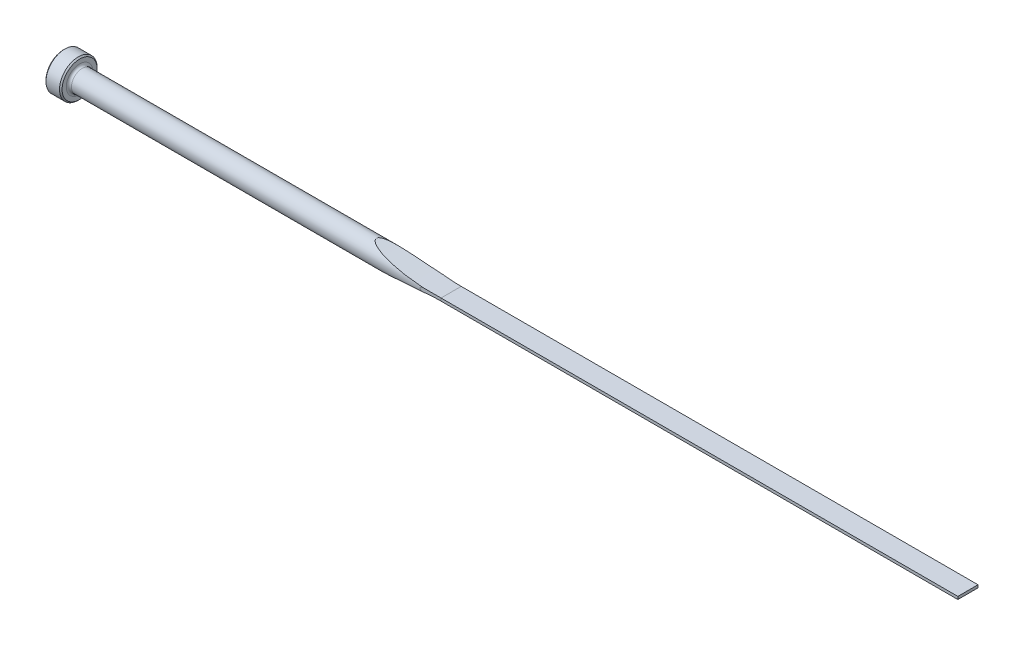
ISO-10303-21;
HEADER;
FILE_DESCRIPTION(('STEP AP214'),'2;1');
FILE_NAME('part.step','',(''),(''),'','','');
FILE_SCHEMA(('AUTOMOTIVE_DESIGN { 1 0 10303 214 1 1 1 1 }'));
ENDSEC;
DATA;
#1=APPLICATION_CONTEXT('core data for automotive mechanical design processes');
#2=APPLICATION_PROTOCOL_DEFINITION('international standard','automotive_design',2000,#1);
#3=PRODUCT_CONTEXT('',#1,'mechanical');
#4=PRODUCT('Part','Part','',(#3));
#5=PRODUCT_RELATED_PRODUCT_CATEGORY('part','',(#4));
#6=PRODUCT_DEFINITION_FORMATION('','',#4);
#7=PRODUCT_DEFINITION_CONTEXT('part definition',#1,'design');
#8=PRODUCT_DEFINITION('design','',#6,#7);
#9=PRODUCT_DEFINITION_SHAPE('','',#8);
#10=(LENGTH_UNIT() NAMED_UNIT(*) SI_UNIT(.MILLI.,.METRE.));
#11=(NAMED_UNIT(*) PLANE_ANGLE_UNIT() SI_UNIT($,.RADIAN.));
#12=(NAMED_UNIT(*) SI_UNIT($,.STERADIAN.) SOLID_ANGLE_UNIT());
#13=UNCERTAINTY_MEASURE_WITH_UNIT(LENGTH_MEASURE(1.E-05),#10,'distance_accuracy_value','');
#14=(GEOMETRIC_REPRESENTATION_CONTEXT(3) GLOBAL_UNCERTAINTY_ASSIGNED_CONTEXT((#13)) GLOBAL_UNIT_ASSIGNED_CONTEXT((#10,
#11,#12)) REPRESENTATION_CONTEXT('',''));
#15=CARTESIAN_POINT('',(0.,0.,0.));
#16=DIRECTION('',(0.,0.,1.));
#17=DIRECTION('',(1.,0.,0.));
#18=AXIS2_PLACEMENT_3D('',#15,#16,#17);
#19=CARTESIAN_POINT('',(0.,0.,0.));
#20=DIRECTION('',(-1.,0.,0.));
#21=DIRECTION('',(0.,0.,1.));
#22=AXIS2_PLACEMENT_3D('',#19,#20,#21);
#23=CYLINDRICAL_SURFACE('',#22,3.175);
#24=CARTESIAN_POINT('',(5.5118,0.,0.));
#25=DIRECTION('',(-1.,0.,0.));
#26=DIRECTION('',(0.,0.,1.));
#27=AXIS2_PLACEMENT_3D('',#24,#25,#26);
#28=CIRCLE('',#27,3.175);
#29=CARTESIAN_POINT('',(5.5118,0.,3.175));
#30=VERTEX_POINT('',#29);
#31=EDGE_CURVE('E153',#30,#30,#28,.F.);
#32=ORIENTED_EDGE('',*,*,#31,.T.);
#33=EDGE_LOOP('',(#32));
#34=FACE_BOUND('',#33,.T.);
#35=CARTESIAN_POINT('',(114.3,1.11760000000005,2.97179999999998));
#36=CARTESIAN_POINT('',(114.035795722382,1.11753103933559,2.97179889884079));
#37=CARTESIAN_POINT('',(113.771581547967,1.11446404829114,2.97297778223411));
#38=CARTESIAN_POINT('',(113.243191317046,1.10185346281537,2.97768913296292));
#39=CARTESIAN_POINT('',(112.979015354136,1.09230645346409,2.98122284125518));
#40=CARTESIAN_POINT('',(112.449383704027,1.06617269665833,2.99066695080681));
#41=CARTESIAN_POINT('',(112.183930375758,1.04954219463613,2.99659211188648));
#42=CARTESIAN_POINT('',(111.653787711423,1.00807205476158,3.01079697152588));
#43=CARTESIAN_POINT('',(111.389098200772,0.983234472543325,3.01907608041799));
#44=CARTESIAN_POINT('',(110.861578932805,0.92338352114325,3.03792875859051));
#45=CARTESIAN_POINT('',(110.598746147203,0.888396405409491,3.04849639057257));
#46=CARTESIAN_POINT('',(110.206465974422,0.825064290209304,3.06600005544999));
#47=CARTESIAN_POINT('',(110.076108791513,0.802161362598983,3.07210597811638));
#48=CARTESIAN_POINT('',(109.816355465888,0.751700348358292,3.08484243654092));
#49=CARTESIAN_POINT('',(109.686959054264,0.724143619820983,3.09147281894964));
#50=CARTESIAN_POINT('',(109.429407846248,0.662714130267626,3.10522998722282));
#51=CARTESIAN_POINT('',(109.301255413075,0.62883116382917,3.11235756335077));
#52=CARTESIAN_POINT('',(109.111128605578,0.570760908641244,3.12333709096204));
#53=CARTESIAN_POINT('',(109.048049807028,0.55017562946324,3.12704828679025));
#54=CARTESIAN_POINT('',(108.92304566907,0.505797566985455,3.13453462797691));
#55=CARTESIAN_POINT('',(108.861119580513,0.482006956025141,3.13830972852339));
#56=CARTESIAN_POINT('',(108.738826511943,0.429769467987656,3.14588980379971));
#57=CARTESIAN_POINT('',(108.678471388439,0.401294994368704,3.14969481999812));
#58=CARTESIAN_POINT('',(108.561395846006,0.337410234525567,3.1571914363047));
#59=CARTESIAN_POINT('',(108.504663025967,0.302025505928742,3.16088339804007));
#60=CARTESIAN_POINT('',(108.431845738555,0.243613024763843,3.16568281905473));
#61=CARTESIAN_POINT('',(108.411687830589,0.225790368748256,3.16701915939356));
#62=CARTESIAN_POINT('',(108.374124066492,0.187442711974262,3.16952077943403));
#63=CARTESIAN_POINT('',(108.356707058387,0.166929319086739,3.17068675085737));
#64=CARTESIAN_POINT('',(108.333583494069,0.132884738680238,3.17224001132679));
#65=CARTESIAN_POINT('',(108.326188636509,0.120518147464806,3.17273788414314));
#66=CARTESIAN_POINT('',(108.313260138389,0.0948283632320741,3.1736095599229));
#67=CARTESIAN_POINT('',(108.307725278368,0.081505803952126,3.17398344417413));
#68=CARTESIAN_POINT('',(108.299008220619,0.0538971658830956,3.1745727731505));
#69=CARTESIAN_POINT('',(108.295856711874,0.0396010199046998,3.17478615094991));
#70=CARTESIAN_POINT('',(108.2924789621,0.0106696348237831,3.17501485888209));
#71=CARTESIAN_POINT('',(108.292248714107,-0.00396511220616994,3.17503046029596));
#72=CARTESIAN_POINT('',(108.294559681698,-0.0309283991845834,3.17487397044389));
#73=CARTESIAN_POINT('',(108.29671675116,-0.0432925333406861,3.17472789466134));
#74=CARTESIAN_POINT('',(108.302965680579,-0.0675187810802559,3.17430516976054));
#75=CARTESIAN_POINT('',(108.307059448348,-0.0793803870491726,3.17402839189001));
#76=CARTESIAN_POINT('',(108.319137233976,-0.107852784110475,3.17321302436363));
#77=CARTESIAN_POINT('',(108.328045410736,-0.124065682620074,3.17261252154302));
#78=CARTESIAN_POINT('',(108.34823262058,-0.154926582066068,3.17125564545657));
#79=CARTESIAN_POINT('',(108.359518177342,-0.169570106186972,3.17049884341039));
#80=CARTESIAN_POINT('',(108.39443410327,-0.20990010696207,3.16816531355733));
#81=CARTESIAN_POINT('',(108.420099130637,-0.233790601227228,3.16645919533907));
#82=CARTESIAN_POINT('',(108.474292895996,-0.277993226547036,3.16288336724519));
#83=CARTESIAN_POINT('',(108.502830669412,-0.29829347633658,3.16101314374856));
#84=CARTESIAN_POINT('',(108.58234132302,-0.349789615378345,3.15584379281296));
#85=CARTESIAN_POINT('',(108.63488873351,-0.378519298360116,3.15247078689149));
#86=CARTESIAN_POINT('',(108.742307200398,-0.43132017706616,3.14567655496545));
#87=CARTESIAN_POINT('',(108.797183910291,-0.455379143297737,3.14225522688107));
#88=CARTESIAN_POINT('',(108.908570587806,-0.500302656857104,3.13541729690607));
#89=CARTESIAN_POINT('',(108.965087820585,-0.521149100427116,3.13200082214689));
#90=CARTESIAN_POINT('',(109.07889793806,-0.560302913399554,3.12523191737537));
#91=CARTESIAN_POINT('',(109.136189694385,-0.578613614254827,3.12187940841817));
#92=CARTESIAN_POINT('',(109.329729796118,-0.636913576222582,3.11074477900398));
#93=CARTESIAN_POINT('',(109.467313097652,-0.672489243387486,3.10314401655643));
#94=CARTESIAN_POINT('',(109.744130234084,-0.736755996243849,3.08850582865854));
#95=CARTESIAN_POINT('',(109.883365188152,-0.765442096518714,3.08146881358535));
#96=CARTESIAN_POINT('',(110.163129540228,-0.817784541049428,3.06799404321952));
#97=CARTESIAN_POINT('',(110.303661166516,-0.841429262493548,3.06155769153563));
#98=CARTESIAN_POINT('',(110.58537320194,-0.884713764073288,3.04932851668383));
#99=CARTESIAN_POINT('',(110.726553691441,-0.904353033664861,3.04353577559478));
#100=CARTESIAN_POINT('',(111.150689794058,-0.958348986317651,3.02714982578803));
#101=CARTESIAN_POINT('',(111.434309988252,-0.987796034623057,3.01754551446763));
#102=CARTESIAN_POINT('',(112.002086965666,-1.03680456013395,3.00105004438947));
#103=CARTESIAN_POINT('',(112.286242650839,-1.05637822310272,2.99415554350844));
#104=CARTESIAN_POINT('',(112.714916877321,-1.0796290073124,2.98581493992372));
#105=CARTESIAN_POINT('',(112.859256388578,-1.08638681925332,2.98335806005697));
#106=CARTESIAN_POINT('',(113.148064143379,-1.09788498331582,2.97914616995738));
#107=CARTESIAN_POINT('',(113.292532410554,-1.10262481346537,2.9773913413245));
#108=CARTESIAN_POINT('',(113.580840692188,-1.11015348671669,2.9745925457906));
#109=CARTESIAN_POINT('',(113.724680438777,-1.11295147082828,2.97354524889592));
#110=CARTESIAN_POINT('',(114.012346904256,-1.11667170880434,2.97214903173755));
#111=CARTESIAN_POINT('',(114.156173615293,-1.11759449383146,2.97179991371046));
#112=CARTESIAN_POINT('',(114.3,-1.11760000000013,2.97179999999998));
#113=B_SPLINE_CURVE_WITH_KNOTS('',3,(#35,#36,#37,#38,#39,#40,#41,#42,#43,#44,#45,#46,#47,#48,
#49,#50,#51,#52,#53,#54,#55,#56,#57,#58,#59,#60,#61,#62,#63,#64,#65,#66,#67,#68,#69,#70,#71,#72,
#73,#74,#75,#76,#77,#78,#79,#80,#81,#82,#83,#84,#85,#86,#87,#88,#89,#90,#91,#92,#93,#94,#95,#96,
#97,#98,#99,#100,#101,#102,#103,#104,#105,#106,#107,#108,#109,#110,#111,#112),.UNSPECIFIED.,.F.,
.F.,(4,2,2,2,2,2,2,2,2,2,2,2,2,2,2,2,2,2,2,2,2,2,2,2,2,2,2,2,2,2,2,2,2,2,2,2,2,2,4),(0.,
0.792608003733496,1.58563403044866,2.38363126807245,3.18142878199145,3.97718078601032,
4.37459807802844,4.77189959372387,5.16984765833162,5.36916585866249,5.5683496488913,
5.76875204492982,5.96842682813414,6.04909120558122,6.12941838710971,6.17255460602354,
6.21566248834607,6.2593164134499,6.30291045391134,6.34039079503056,6.37790813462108,
6.43311579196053,6.4884769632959,6.59320183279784,6.69826703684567,6.87774508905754,
7.05768691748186,7.23860836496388,7.41928981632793,7.84588397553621,8.27278590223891,
8.70066164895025,9.12859189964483,9.98423938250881,10.8388282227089,11.2723701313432,
11.7060241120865,12.137622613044,12.569098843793),.UNSPECIFIED.);
#114=CARTESIAN_POINT('',(109.07888962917,0.559850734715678,3.12525073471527));
#115=VERTEX_POINT('',#114);
#116=CARTESIAN_POINT('',(109.078889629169,-0.559850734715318,3.12525073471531));
#117=VERTEX_POINT('',#116);
#118=EDGE_CURVE('E156',#115,#117,#113,.T.);
#119=ORIENTED_EDGE('',*,*,#118,.F.);
#120=CARTESIAN_POINT('',(114.3,0.406399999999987,3.14888298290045));
#121=CARTESIAN_POINT('',(113.772803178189,0.406399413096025,3.14883682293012));
#122=CARTESIAN_POINT('',(113.245605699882,0.411089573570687,3.1482760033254));
#123=CARTESIAN_POINT('',(112.191212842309,0.429850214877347,3.14579424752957));
#124=CARTESIAN_POINT('',(111.664017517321,0.443923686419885,3.14387287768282));
#125=CARTESIAN_POINT('',(110.605273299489,0.481616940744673,3.13831417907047));
#126=CARTESIAN_POINT('',(110.073727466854,0.505320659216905,3.13466171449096));
#127=CARTESIAN_POINT('',(109.011333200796,0.562257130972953,3.12495310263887));
#128=CARTESIAN_POINT('',(108.480484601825,0.595486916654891,3.11889770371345));
#129=CARTESIAN_POINT('',(107.416801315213,0.671658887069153,3.1033881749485));
#130=CARTESIAN_POINT('',(106.88397036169,0.71464989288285,3.09391681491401));
#131=CARTESIAN_POINT('',(105.819242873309,0.810227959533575,3.07027392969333));
#132=CARTESIAN_POINT('',(105.287346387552,0.862815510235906,3.05610216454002));
#133=CARTESIAN_POINT('',(104.223889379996,0.9776476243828,3.02133113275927));
#134=CARTESIAN_POINT('',(103.69233094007,1.03990833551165,3.00072105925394));
#135=CARTESIAN_POINT('',(102.630877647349,1.17395582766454,2.95085902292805));
#136=CARTESIAN_POINT('',(102.100982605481,1.24574148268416,2.9216080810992));
#137=CARTESIAN_POINT('',(101.04631407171,1.39831156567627,2.85173438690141));
#138=CARTESIAN_POINT('',(100.52152863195,1.47904206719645,2.81117776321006));
#139=CARTESIAN_POINT('',(99.7364139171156,1.60701374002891,2.73870608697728));
#140=CARTESIAN_POINT('',(99.4749847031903,1.65082933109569,2.71260104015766));
#141=CARTESIAN_POINT('',(98.9530103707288,1.74071020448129,2.65582140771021));
#142=CARTESIAN_POINT('',(98.6924652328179,1.78677543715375,2.62514692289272));
#143=CARTESIAN_POINT('',(98.1732649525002,1.88095855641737,2.55850308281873));
#144=CARTESIAN_POINT('',(97.9146064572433,1.92906965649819,2.52255039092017));
#145=CARTESIAN_POINT('',(97.3986683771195,2.02739943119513,2.44422445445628));
#146=CARTESIAN_POINT('',(97.1413887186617,2.0776179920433,2.40185155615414));
#147=CARTESIAN_POINT('',(96.6288453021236,2.18000599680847,2.30932005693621));
#148=CARTESIAN_POINT('',(96.3735800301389,2.23217376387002,2.25916803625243));
#149=CARTESIAN_POINT('',(95.8655530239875,2.33831139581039,2.14913837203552));
#150=CARTESIAN_POINT('',(95.6127906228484,2.39228076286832,2.08926339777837));
#151=CARTESIAN_POINT('',(95.2868484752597,2.46334629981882,2.00329722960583));
#152=CARTESIAN_POINT('',(95.2119962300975,2.47976837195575,1.98294830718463));
#153=CARTESIAN_POINT('',(95.0626651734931,2.51273206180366,1.94100880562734));
#154=CARTESIAN_POINT('',(94.98818637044,2.52927368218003,1.91941819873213));
#155=CARTESIAN_POINT('',(94.7653356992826,2.57906834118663,1.85260027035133));
#156=CARTESIAN_POINT('',(94.6175981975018,2.61248057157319,1.80533950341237));
#157=CARTESIAN_POINT('',(94.3251288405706,2.67940118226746,1.70443079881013));
#158=CARTESIAN_POINT('',(94.1803862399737,2.71290840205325,1.65081343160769));
#159=CARTESIAN_POINT('',(93.8942424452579,2.77989194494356,1.5353510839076));
#160=CARTESIAN_POINT('',(93.7528393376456,2.81336827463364,1.47351095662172));
#161=CARTESIAN_POINT('',(93.5196072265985,2.86917007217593,1.36054096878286));
#162=CARTESIAN_POINT('',(93.4264055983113,2.8916329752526,1.31232429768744));
#163=CARTESIAN_POINT('',(93.242822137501,2.93618406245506,1.2093911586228));
#164=CARTESIAN_POINT('',(93.1524577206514,2.95826965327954,1.15464182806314));
#165=CARTESIAN_POINT('',(93.0072758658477,2.99398257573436,1.05752329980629));
#166=CARTESIAN_POINT('',(92.9509993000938,3.00788688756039,1.01744577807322));
#167=CARTESIAN_POINT('',(92.8413340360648,3.03509050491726,0.933175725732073));
#168=CARTESIAN_POINT('',(92.7879480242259,3.04838924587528,0.888979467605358));
#169=CARTESIAN_POINT('',(92.6856978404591,3.0739542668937,0.796075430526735));
#170=CARTESIAN_POINT('',(92.6368023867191,3.08622762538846,0.747404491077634));
#171=CARTESIAN_POINT('',(92.5449929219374,3.10934730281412,0.64448319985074));
#172=CARTESIAN_POINT('',(92.5020641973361,3.12019712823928,0.59024716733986));
#173=CARTESIAN_POINT('',(92.4353153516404,3.13711069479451,0.490885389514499));
#174=CARTESIAN_POINT('',(92.4094604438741,3.14367703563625,0.44722882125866));
#175=CARTESIAN_POINT('',(92.3639685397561,3.15524751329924,0.356543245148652));
#176=CARTESIAN_POINT('',(92.3443286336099,3.16025238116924,0.309515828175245));
#177=CARTESIAN_POINT('',(92.3128254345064,3.16828747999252,0.212100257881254));
#178=CARTESIAN_POINT('',(92.3010513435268,3.17129505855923,0.161680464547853));
#179=CARTESIAN_POINT('',(92.2871228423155,3.17485352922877,0.0594487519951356));
#180=CARTESIAN_POINT('',(92.284957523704,3.17540720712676,0.00763847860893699));
#181=CARTESIAN_POINT('',(92.2902196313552,3.17406246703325,-0.0898767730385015));
#182=CARTESIAN_POINT('',(92.2966487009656,3.17241924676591,-0.135643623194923));
#183=CARTESIAN_POINT('',(92.3166803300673,3.16730457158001,-0.225468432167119));
#184=CARTESIAN_POINT('',(92.3302891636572,3.16383151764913,-0.269524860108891));
#185=CARTESIAN_POINT('',(92.3699307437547,3.15372958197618,-0.371724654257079));
#186=CARTESIAN_POINT('',(92.3987343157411,3.14639931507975,-0.428711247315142));
#187=CARTESIAN_POINT('',(92.4645973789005,3.12968420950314,-0.537350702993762));
#188=CARTESIAN_POINT('',(92.5016775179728,3.12029423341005,-0.58898974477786));
#189=CARTESIAN_POINT('',(92.5771295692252,3.10124790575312,-0.681815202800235));
#190=CARTESIAN_POINT('',(92.6149059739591,3.0917356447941,-0.723526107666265));
#191=CARTESIAN_POINT('',(92.6938080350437,3.07192820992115,-0.803480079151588));
#192=CARTESIAN_POINT('',(92.7349365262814,3.06163237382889,-0.841720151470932));
#193=CARTESIAN_POINT('',(92.8197653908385,3.04046560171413,-0.915237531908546));
#194=CARTESIAN_POINT('',(92.8634713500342,3.02959342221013,-0.950507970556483));
#195=CARTESIAN_POINT('',(92.952768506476,3.00745547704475,-1.01838527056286));
#196=CARTESIAN_POINT('',(92.9983590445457,2.99618984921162,-1.05099305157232));
#197=CARTESIAN_POINT('',(93.1147566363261,2.96752891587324,-1.13002904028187));
#198=CARTESIAN_POINT('',(93.186518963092,2.94994951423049,-1.17498145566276));
#199=CARTESIAN_POINT('',(93.332483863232,2.9143926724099,-1.26058638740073));
#200=CARTESIAN_POINT('',(93.4066876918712,2.89641502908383,-1.30123664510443));
#201=CARTESIAN_POINT('',(93.6322339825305,2.84208755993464,-1.417952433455));
#202=CARTESIAN_POINT('',(93.7862784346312,2.80540063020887,-1.48863316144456));
#203=CARTESIAN_POINT('',(94.0994399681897,2.7317301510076,-1.61985238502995));
#204=CARTESIAN_POINT('',(94.2585796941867,2.69474606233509,-1.68033486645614));
#205=CARTESIAN_POINT('',(94.4993746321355,2.63949733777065,-1.76487976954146));
#206=CARTESIAN_POINT('',(94.5799431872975,2.62112883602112,-1.79201863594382));
#207=CARTESIAN_POINT('',(94.7416943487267,2.5844906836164,-1.84446667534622));
#208=CARTESIAN_POINT('',(94.822876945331,2.56622103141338,-1.86977587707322));
#209=CARTESIAN_POINT('',(95.0642696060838,2.5122554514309,-1.94236919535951));
#210=CARTESIAN_POINT('',(95.2252232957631,2.47673763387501,-1.98731870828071));
#211=CARTESIAN_POINT('',(95.5486359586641,2.40632088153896,-2.07202108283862));
#212=CARTESIAN_POINT('',(95.7110951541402,2.37142204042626,-2.11177316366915));
#213=CARTESIAN_POINT('',(96.0372522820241,2.3023205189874,-2.18690459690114));
#214=CARTESIAN_POINT('',(96.2009507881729,2.26811819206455,-2.22228177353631));
#215=CARTESIAN_POINT('',(96.5292805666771,2.20048954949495,-2.28926395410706));
#216=CARTESIAN_POINT('',(96.6939118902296,2.16706327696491,-2.32086874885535));
#217=CARTESIAN_POINT('',(97.18969978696,2.06786854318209,-2.41092753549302));
#218=CARTESIAN_POINT('',(97.5220028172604,2.00334264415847,-2.4644590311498));
#219=CARTESIAN_POINT('',(98.188626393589,1.87786522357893,-2.56134692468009));
#220=CARTESIAN_POINT('',(98.5229463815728,1.81691275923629,-2.60470601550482));
#221=CARTESIAN_POINT('',(99.1934521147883,1.69864808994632,-2.68333066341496));
#222=CARTESIAN_POINT('',(99.529639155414,1.64133888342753,-2.71858961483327));
#223=CARTESIAN_POINT('',(100.203273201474,1.5304988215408,-2.7824962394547));
#224=CARTESIAN_POINT('',(100.540720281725,1.47696819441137,-2.81114351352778));
#225=CARTESIAN_POINT('',(101.216177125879,1.37381132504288,-2.86296929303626));
#226=CARTESIAN_POINT('',(101.554185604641,1.3241801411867,-2.88615479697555));
#227=CARTESIAN_POINT('',(102.231026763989,1.22878254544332,-2.92804175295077));
#228=CARTESIAN_POINT('',(102.569859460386,1.18301620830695,-2.94674311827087));
#229=CARTESIAN_POINT('',(103.367970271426,1.0799025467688,-2.98638238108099));
#230=CARTESIAN_POINT('',(103.827534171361,1.02417174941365,-3.00577850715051));
#231=CARTESIAN_POINT('',(104.747668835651,0.91987746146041,-3.03931641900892));
#232=CARTESIAN_POINT('',(105.208239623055,0.871314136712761,-3.05345808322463));
#233=CARTESIAN_POINT('',(106.130378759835,0.78136407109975,-3.07770450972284));
#234=CARTESIAN_POINT('',(106.591947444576,0.739980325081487,-3.08780758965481));
#235=CARTESIAN_POINT('',(107.515739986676,0.664431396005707,-3.10494040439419));
#236=CARTESIAN_POINT('',(107.977963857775,0.630266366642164,-3.11197007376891));
#237=CARTESIAN_POINT('',(108.902051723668,0.569225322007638,-3.12371109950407));
#238=CARTESIAN_POINT('',(109.363914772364,0.542335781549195,-3.12842677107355));
#239=CARTESIAN_POINT('',(110.288009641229,0.495770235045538,-3.13614311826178));
#240=CARTESIAN_POINT('',(110.750241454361,0.476094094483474,-3.13914382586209));
#241=CARTESIAN_POINT('',(111.674877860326,0.443963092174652,-3.14384867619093));
#242=CARTESIAN_POINT('',(112.137282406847,0.431506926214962,-3.14555305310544));
#243=CARTESIAN_POINT('',(113.062224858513,0.41381390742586,-3.14793029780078));
#244=CARTESIAN_POINT('',(113.524762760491,0.408576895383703,-3.14860318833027));
#245=CARTESIAN_POINT('',(114.091538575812,0.406583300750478,-3.14885900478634));
#246=CARTESIAN_POINT('',(114.195769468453,0.406399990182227,-3.14888248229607));
#247=CARTESIAN_POINT('',(114.3,0.406399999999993,-3.14888298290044));
#248=B_SPLINE_CURVE_WITH_KNOTS('',3,(#120,#121,#122,#123,#124,#125,#126,#127,#128,#129,#130,
#131,#132,#133,#134,#135,#136,#137,#138,#139,#140,#141,#142,#143,#144,#145,#146,#147,#148,#149,
#150,#151,#152,#153,#154,#155,#156,#157,#158,#159,#160,#161,#162,#163,#164,#165,#166,#167,#168,
#169,#170,#171,#172,#173,#174,#175,#176,#177,#178,#179,#180,#181,#182,#183,#184,#185,#186,#187,
#188,#189,#190,#191,#192,#193,#194,#195,#196,#197,#198,#199,#200,#201,#202,#203,#204,#205,#206,
#207,#208,#209,#210,#211,#212,#213,#214,#215,#216,#217,#218,#219,#220,#221,#222,#223,#224,#225,
#226,#227,#228,#229,#230,#231,#232,#233,#234,#235,#236,#237,#238,#239,#240,#241,#242,#243,#244,
#245,#246,#247),.UNSPECIFIED.,.F.,.F.,(4,2,2,2,2,2,2,2,2,2,2,2,2,2,2,2,2,2,2,2,2,2,2,2,2,2,2,2,
2,2,2,2,2,2,2,2,2,2,2,2,2,2,2,2,2,2,2,2,2,2,2,2,2,2,2,2,2,2,2,2,2,2,2,4),(0.,1.58157033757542,
3.16364500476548,4.75981516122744,6.35548861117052,7.95932589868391,9.5632450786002,
11.1698710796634,12.7763073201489,14.3735376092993,15.1725715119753,15.9715877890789,
16.7681337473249,17.5646367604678,18.3604696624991,19.1560844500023,19.3939402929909,
19.6318014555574,20.107677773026,20.5813518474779,21.0547475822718,21.3765248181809,
21.6999950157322,21.9112808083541,22.1227597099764,22.3326314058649,22.541976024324,
22.6950563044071,22.8480648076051,23.0027803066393,23.1573201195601,23.2953796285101,
23.4335599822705,23.6252860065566,23.8174957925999,23.9884662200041,24.1595827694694,
24.3310848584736,24.5025274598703,24.761782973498,25.0211739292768,25.540800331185,
26.0631938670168,26.3241095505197,26.585021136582,27.0974386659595,27.609933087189,
28.1226813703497,28.6354580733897,29.6633558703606,30.6909812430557,31.7194416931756,
32.7479642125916,33.7751615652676,34.8023787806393,36.1922887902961,37.5822309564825,
38.9727515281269,40.3633017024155,41.7512487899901,43.1391699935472,44.5268404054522,
45.9144802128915,46.2271726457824),.UNSPECIFIED.);
#249=CARTESIAN_POINT('',(109.07888962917,0.559850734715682,-3.12525073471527));
#250=VERTEX_POINT('',#249);
#251=EDGE_CURVE('E106',#115,#250,#248,.T.);
#252=ORIENTED_EDGE('',*,*,#251,.T.);
#253=CARTESIAN_POINT('',(114.3,1.11760000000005,-2.97179999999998));
#254=CARTESIAN_POINT('',(114.035795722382,1.11753103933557,-2.9717988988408));
#255=CARTESIAN_POINT('',(113.771581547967,1.11446404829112,-2.97297778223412));
#256=CARTESIAN_POINT('',(113.243191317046,1.10185346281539,-2.97768913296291));
#257=CARTESIAN_POINT('',(112.979015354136,1.09230645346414,-2.98122284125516));
#258=CARTESIAN_POINT('',(112.449383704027,1.06617269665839,-2.99066695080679));
#259=CARTESIAN_POINT('',(112.183930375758,1.04954219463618,-2.99659211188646));
#260=CARTESIAN_POINT('',(111.653787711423,1.00807205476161,-3.01079697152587));
#261=CARTESIAN_POINT('',(111.389098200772,0.983234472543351,-3.01907608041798));
#262=CARTESIAN_POINT('',(110.861578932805,0.923383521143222,-3.03792875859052));
#263=CARTESIAN_POINT('',(110.598746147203,0.888396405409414,-3.04849639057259));
#264=CARTESIAN_POINT('',(110.206465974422,0.825064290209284,-3.06600005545));
#265=CARTESIAN_POINT('',(110.076108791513,0.802161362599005,-3.07210597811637));
#266=CARTESIAN_POINT('',(109.816355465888,0.751700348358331,-3.08484243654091));
#267=CARTESIAN_POINT('',(109.686959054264,0.724143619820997,-3.09147281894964));
#268=CARTESIAN_POINT('',(109.429407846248,0.662714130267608,-3.10522998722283));
#269=CARTESIAN_POINT('',(109.301255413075,0.628831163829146,-3.11235756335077));
#270=CARTESIAN_POINT('',(109.111128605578,0.570760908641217,-3.12333709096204));
#271=CARTESIAN_POINT('',(109.048049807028,0.55017562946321,-3.12704828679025));
#272=CARTESIAN_POINT('',(108.92304566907,0.505797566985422,-3.13453462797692));
#273=CARTESIAN_POINT('',(108.861119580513,0.482006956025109,-3.13830972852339));
#274=CARTESIAN_POINT('',(108.738826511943,0.42976946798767,-3.1458898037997));
#275=CARTESIAN_POINT('',(108.678471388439,0.401294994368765,-3.14969481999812));
#276=CARTESIAN_POINT('',(108.561395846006,0.337410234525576,-3.15719143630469));
#277=CARTESIAN_POINT('',(108.504663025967,0.302025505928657,-3.16088339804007));
#278=CARTESIAN_POINT('',(108.431845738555,0.243613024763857,-3.16568281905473));
#279=CARTESIAN_POINT('',(108.411687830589,0.225790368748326,-3.16701915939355));
#280=CARTESIAN_POINT('',(108.374124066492,0.187442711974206,-3.16952077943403));
#281=CARTESIAN_POINT('',(108.356707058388,0.166929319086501,-3.17068675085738));
#282=CARTESIAN_POINT('',(108.333583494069,0.132884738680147,-3.1722400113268));
#283=CARTESIAN_POINT('',(108.326188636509,0.120518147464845,-3.17273788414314));
#284=CARTESIAN_POINT('',(108.313260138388,0.0948283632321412,-3.1736095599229));
#285=CARTESIAN_POINT('',(108.307725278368,0.0815058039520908,-3.17398344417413));
#286=CARTESIAN_POINT('',(108.299008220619,0.0538971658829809,-3.1745727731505));
#287=CARTESIAN_POINT('',(108.295856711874,0.0396010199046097,-3.17478615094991));
#288=CARTESIAN_POINT('',(108.2924789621,0.0106696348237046,-3.17501485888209));
#289=CARTESIAN_POINT('',(108.292248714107,-0.00396511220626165,-3.17503046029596));
#290=CARTESIAN_POINT('',(108.294559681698,-0.0309283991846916,-3.17487397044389));
#291=CARTESIAN_POINT('',(108.29671675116,-0.0432925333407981,-3.17472789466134));
#292=CARTESIAN_POINT('',(108.302965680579,-0.0675187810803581,-3.17430516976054));
#293=CARTESIAN_POINT('',(108.307059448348,-0.0793803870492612,-3.17402839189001));
#294=CARTESIAN_POINT('',(108.319137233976,-0.107852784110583,-3.17321302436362));
#295=CARTESIAN_POINT('',(108.328045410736,-0.124065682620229,-3.17261252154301));
#296=CARTESIAN_POINT('',(108.34823262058,-0.154926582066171,-3.17125564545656));
#297=CARTESIAN_POINT('',(108.359518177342,-0.169570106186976,-3.17049884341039));
#298=CARTESIAN_POINT('',(108.39443410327,-0.209900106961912,-3.16816531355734));
#299=CARTESIAN_POINT('',(108.420099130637,-0.233790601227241,-3.16645919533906));
#300=CARTESIAN_POINT('',(108.474292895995,-0.27799322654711,-3.16288336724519));
#301=CARTESIAN_POINT('',(108.502830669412,-0.298293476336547,-3.16101314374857));
#302=CARTESIAN_POINT('',(108.58234132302,-0.349789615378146,-3.15584379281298));
#303=CARTESIAN_POINT('',(108.63488873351,-0.378519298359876,-3.15247078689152));
#304=CARTESIAN_POINT('',(108.742307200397,-0.431320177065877,-3.14567655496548));
#305=CARTESIAN_POINT('',(108.79718391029,-0.455379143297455,-3.14225522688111));
#306=CARTESIAN_POINT('',(108.908570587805,-0.500302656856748,-3.13541729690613));
#307=CARTESIAN_POINT('',(108.965087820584,-0.521149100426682,-3.13200082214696));
#308=CARTESIAN_POINT('',(109.078897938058,-0.56030291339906,-3.12523191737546));
#309=CARTESIAN_POINT('',(109.136189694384,-0.578613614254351,-3.12187940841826));
#310=CARTESIAN_POINT('',(109.329729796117,-0.636913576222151,-3.11074477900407));
#311=CARTESIAN_POINT('',(109.46731309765,-0.672489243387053,-3.10314401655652));
#312=CARTESIAN_POINT('',(109.744130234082,-0.736755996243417,-3.08850582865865));
#313=CARTESIAN_POINT('',(109.88336518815,-0.765442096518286,-3.08146881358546));
#314=CARTESIAN_POINT('',(110.163129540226,-0.81778454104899,-3.06799404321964));
#315=CARTESIAN_POINT('',(110.303661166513,-0.841429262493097,-3.06155769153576));
#316=CARTESIAN_POINT('',(110.585373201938,-0.884713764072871,-3.04932851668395));
#317=CARTESIAN_POINT('',(110.726553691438,-0.904353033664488,-3.04353577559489));
#318=CARTESIAN_POINT('',(111.150689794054,-0.958348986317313,-3.02714982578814));
#319=CARTESIAN_POINT('',(111.434309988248,-0.987796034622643,-3.01754551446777));
#320=CARTESIAN_POINT('',(112.002086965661,-1.03680456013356,-3.0010500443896));
#321=CARTESIAN_POINT('',(112.286242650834,-1.05637822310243,-2.99415554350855));
#322=CARTESIAN_POINT('',(112.714916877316,-1.07962900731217,-2.98581493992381));
#323=CARTESIAN_POINT('',(112.859256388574,-1.0863868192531,-2.98335806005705));
#324=CARTESIAN_POINT('',(113.148064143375,-1.09788498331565,-2.97914616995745));
#325=CARTESIAN_POINT('',(113.292532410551,-1.10262481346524,-2.97739134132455));
#326=CARTESIAN_POINT('',(113.580840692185,-1.11015348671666,-2.97459254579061));
#327=CARTESIAN_POINT('',(113.724680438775,-1.11295147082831,-2.97354524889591));
#328=CARTESIAN_POINT('',(114.012346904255,-1.11667170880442,-2.97214903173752));
#329=CARTESIAN_POINT('',(114.156173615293,-1.11759449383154,-2.97179991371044));
#330=CARTESIAN_POINT('',(114.3,-1.11760000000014,-2.97179999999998));
#331=B_SPLINE_CURVE_WITH_KNOTS('',3,(#253,#254,#255,#256,#257,#258,#259,#260,#261,#262,#263,
#264,#265,#266,#267,#268,#269,#270,#271,#272,#273,#274,#275,#276,#277,#278,#279,#280,#281,#282,
#283,#284,#285,#286,#287,#288,#289,#290,#291,#292,#293,#294,#295,#296,#297,#298,#299,#300,#301,
#302,#303,#304,#305,#306,#307,#308,#309,#310,#311,#312,#313,#314,#315,#316,#317,#318,#319,#320,
#321,#322,#323,#324,#325,#326,#327,#328,#329,#330),.UNSPECIFIED.,.F.,.F.,(4,2,2,2,2,2,2,2,2,2,2,
2,2,2,2,2,2,2,2,2,2,2,2,2,2,2,2,2,2,2,2,2,2,2,2,2,2,2,4),(0.,0.792608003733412,1.58563403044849,
2.38363126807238,3.18142878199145,3.97718078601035,4.37459807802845,4.77189959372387,
5.16984765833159,5.36916585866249,5.5683496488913,5.76875204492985,5.96842682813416,
6.04909120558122,6.12941838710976,6.1725546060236,6.21566248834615,6.25931641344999,
6.30291045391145,6.34039079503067,6.37790813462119,6.43311579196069,6.48847696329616,
6.59320183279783,6.69826703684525,6.87774508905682,7.05768691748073,7.23860836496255,
7.41928981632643,7.84588397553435,8.27278590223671,8.70066164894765,9.12859189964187,
9.98423938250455,10.8388282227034,11.272370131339,11.7060241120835,12.1376226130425,
12.569098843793),.UNSPECIFIED.);
#332=CARTESIAN_POINT('',(109.078889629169,-0.559850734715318,-3.12525073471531));
#333=VERTEX_POINT('',#332);
#334=EDGE_CURVE('E175',#250,#333,#331,.T.);
#335=ORIENTED_EDGE('',*,*,#334,.T.);
#336=CARTESIAN_POINT('',(114.3,-0.406399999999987,3.14888298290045));
#337=CARTESIAN_POINT('',(113.772803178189,-0.406399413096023,3.14883682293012));
#338=CARTESIAN_POINT('',(113.245605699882,-0.411089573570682,3.1482760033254));
#339=CARTESIAN_POINT('',(112.191212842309,-0.429850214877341,3.14579424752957));
#340=CARTESIAN_POINT('',(111.664017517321,-0.443923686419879,3.14387287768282));
#341=CARTESIAN_POINT('',(110.605273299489,-0.481616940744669,3.13831417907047));
#342=CARTESIAN_POINT('',(110.073727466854,-0.505320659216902,3.13466171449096));
#343=CARTESIAN_POINT('',(109.011333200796,-0.562257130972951,3.12495310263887));
#344=CARTESIAN_POINT('',(108.480484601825,-0.59548691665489,3.11889770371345));
#345=CARTESIAN_POINT('',(107.416801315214,-0.671658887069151,3.1033881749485));
#346=CARTESIAN_POINT('',(106.88397036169,-0.714649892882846,3.09391681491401));
#347=CARTESIAN_POINT('',(105.819242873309,-0.810227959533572,3.07027392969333));
#348=CARTESIAN_POINT('',(105.287346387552,-0.862815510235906,3.05610216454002));
#349=CARTESIAN_POINT('',(104.223889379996,-0.977647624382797,3.02133113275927));
#350=CARTESIAN_POINT('',(103.69233094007,-1.03990833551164,3.00072105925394));
#351=CARTESIAN_POINT('',(102.630877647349,-1.17395582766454,2.95085902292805));
#352=CARTESIAN_POINT('',(102.100982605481,-1.24574148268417,2.92160808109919));
#353=CARTESIAN_POINT('',(101.04631407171,-1.39831156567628,2.85173438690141));
#354=CARTESIAN_POINT('',(100.52152863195,-1.47904206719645,2.81117776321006));
#355=CARTESIAN_POINT('',(99.7364139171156,-1.6070137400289,2.73870608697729));
#356=CARTESIAN_POINT('',(99.4749847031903,-1.65082933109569,2.71260104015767));
#357=CARTESIAN_POINT('',(98.9530103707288,-1.74071020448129,2.65582140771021));
#358=CARTESIAN_POINT('',(98.6924652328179,-1.78677543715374,2.62514692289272));
#359=CARTESIAN_POINT('',(98.1732649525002,-1.88095855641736,2.55850308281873));
#360=CARTESIAN_POINT('',(97.9146064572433,-1.92906965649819,2.52255039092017));
#361=CARTESIAN_POINT('',(97.3986683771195,-2.02739943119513,2.44422445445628));
#362=CARTESIAN_POINT('',(97.1413887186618,-2.0776179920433,2.40185155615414));
#363=CARTESIAN_POINT('',(96.6288453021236,-2.18000599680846,2.30932005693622));
#364=CARTESIAN_POINT('',(96.3735800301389,-2.23217376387,2.25916803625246));
#365=CARTESIAN_POINT('',(95.8655530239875,-2.3383113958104,2.1491383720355));
#366=CARTESIAN_POINT('',(95.6127906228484,-2.39228076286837,2.0892633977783));
#367=CARTESIAN_POINT('',(95.2868484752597,-2.46334629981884,2.00329722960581));
#368=CARTESIAN_POINT('',(95.2119962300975,-2.47976837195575,1.98294830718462));
#369=CARTESIAN_POINT('',(95.062665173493,-2.51273206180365,1.94100880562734));
#370=CARTESIAN_POINT('',(94.98818637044,-2.52927368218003,1.91941819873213));
#371=CARTESIAN_POINT('',(94.7653356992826,-2.57906834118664,1.85260027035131));
#372=CARTESIAN_POINT('',(94.6175981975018,-2.6124805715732,1.80533950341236));
#373=CARTESIAN_POINT('',(94.3251288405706,-2.67940118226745,1.70443079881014));
#374=CARTESIAN_POINT('',(94.1803862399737,-2.71290840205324,1.65081343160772));
#375=CARTESIAN_POINT('',(93.8942424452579,-2.77989194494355,1.53535108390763));
#376=CARTESIAN_POINT('',(93.7528393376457,-2.81336827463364,1.47351095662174));
#377=CARTESIAN_POINT('',(93.5196072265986,-2.86917007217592,1.36054096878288));
#378=CARTESIAN_POINT('',(93.4264055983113,-2.89163297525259,1.31232429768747));
#379=CARTESIAN_POINT('',(93.2428221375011,-2.93618406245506,1.20939115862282));
#380=CARTESIAN_POINT('',(93.1524577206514,-2.95826965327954,1.15464182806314));
#381=CARTESIAN_POINT('',(93.0072758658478,-2.99398257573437,1.05752329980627));
#382=CARTESIAN_POINT('',(92.9509993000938,-3.00788688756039,1.0174457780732));
#383=CARTESIAN_POINT('',(92.8413340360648,-3.03509050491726,0.93317572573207));
#384=CARTESIAN_POINT('',(92.7879480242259,-3.04838924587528,0.888979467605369));
#385=CARTESIAN_POINT('',(92.6856978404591,-3.0739542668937,0.79607543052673));
#386=CARTESIAN_POINT('',(92.6368023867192,-3.08622762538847,0.747404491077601));
#387=CARTESIAN_POINT('',(92.5449929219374,-3.10934730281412,0.644483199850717));
#388=CARTESIAN_POINT('',(92.502064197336,-3.12019712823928,0.590247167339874));
#389=CARTESIAN_POINT('',(92.4353153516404,-3.13711069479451,0.490885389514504));
#390=CARTESIAN_POINT('',(92.4094604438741,-3.14367703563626,0.447228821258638));
#391=CARTESIAN_POINT('',(92.3639685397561,-3.15524751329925,0.356543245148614));
#392=CARTESIAN_POINT('',(92.3443286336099,-3.16025238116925,0.309515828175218));
#393=CARTESIAN_POINT('',(92.3128254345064,-3.16828747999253,0.212100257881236));
#394=CARTESIAN_POINT('',(92.3010513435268,-3.17129505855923,0.161680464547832));
#395=CARTESIAN_POINT('',(92.2871228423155,-3.17485352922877,0.0594487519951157));
#396=CARTESIAN_POINT('',(92.284957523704,-3.17540720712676,0.00763847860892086));
#397=CARTESIAN_POINT('',(92.2902196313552,-3.17406246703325,-0.0898767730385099));
#398=CARTESIAN_POINT('',(92.2966487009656,-3.17241924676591,-0.135643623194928));
#399=CARTESIAN_POINT('',(92.3166803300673,-3.16730457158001,-0.225468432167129));
#400=CARTESIAN_POINT('',(92.3302891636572,-3.16383151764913,-0.26952486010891));
#401=CARTESIAN_POINT('',(92.3699307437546,-3.15372958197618,-0.371724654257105));
#402=CARTESIAN_POINT('',(92.398734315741,-3.14639931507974,-0.42871124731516));
#403=CARTESIAN_POINT('',(92.4645973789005,-3.12968420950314,-0.537350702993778));
#404=CARTESIAN_POINT('',(92.5016775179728,-3.12029423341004,-0.588989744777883));
#405=CARTESIAN_POINT('',(92.5771295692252,-3.10124790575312,-0.681815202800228));
#406=CARTESIAN_POINT('',(92.6149059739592,-3.09173564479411,-0.723526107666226));
#407=CARTESIAN_POINT('',(92.6938080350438,-3.07192820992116,-0.803480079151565));
#408=CARTESIAN_POINT('',(92.7349365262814,-3.06163237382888,-0.841720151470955));
#409=CARTESIAN_POINT('',(92.8197653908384,-3.04046560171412,-0.915237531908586));
#410=CARTESIAN_POINT('',(92.8634713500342,-3.02959342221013,-0.950507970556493));
#411=CARTESIAN_POINT('',(92.952768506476,-3.00745547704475,-1.01838527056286));
#412=CARTESIAN_POINT('',(92.9983590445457,-2.99618984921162,-1.05099305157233));
#413=CARTESIAN_POINT('',(93.114756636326,-2.96752891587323,-1.1300290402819));
#414=CARTESIAN_POINT('',(93.186518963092,-2.94994951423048,-1.17498145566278));
#415=CARTESIAN_POINT('',(93.332483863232,-2.9143926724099,-1.26058638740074));
#416=CARTESIAN_POINT('',(93.4066876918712,-2.89641502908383,-1.30123664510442));
#417=CARTESIAN_POINT('',(93.6322339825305,-2.84208755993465,-1.41795243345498));
#418=CARTESIAN_POINT('',(93.7862784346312,-2.80540063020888,-1.48863316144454));
#419=CARTESIAN_POINT('',(94.0994399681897,-2.73173015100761,-1.61985238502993));
#420=CARTESIAN_POINT('',(94.2585796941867,-2.6947460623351,-1.68033486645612));
#421=CARTESIAN_POINT('',(94.4993746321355,-2.63949733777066,-1.76487976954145));
#422=CARTESIAN_POINT('',(94.5799431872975,-2.62112883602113,-1.79201863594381));
#423=CARTESIAN_POINT('',(94.7416943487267,-2.58449068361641,-1.84446667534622));
#424=CARTESIAN_POINT('',(94.822876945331,-2.56622103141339,-1.86977587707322));
#425=CARTESIAN_POINT('',(95.0642696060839,-2.5122554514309,-1.9423691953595));
#426=CARTESIAN_POINT('',(95.2252232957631,-2.47673763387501,-1.98731870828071));
#427=CARTESIAN_POINT('',(95.5486359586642,-2.40632088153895,-2.07202108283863));
#428=CARTESIAN_POINT('',(95.7110951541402,-2.37142204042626,-2.11177316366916));
#429=CARTESIAN_POINT('',(96.0372522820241,-2.30232051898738,-2.18690459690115));
#430=CARTESIAN_POINT('',(96.2009507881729,-2.26811819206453,-2.22228177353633));
#431=CARTESIAN_POINT('',(96.5292805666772,-2.20048954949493,-2.28926395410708));
#432=CARTESIAN_POINT('',(96.6939118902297,-2.16706327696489,-2.32086874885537));
#433=CARTESIAN_POINT('',(97.1896997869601,-2.06786854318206,-2.41092753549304));
#434=CARTESIAN_POINT('',(97.5220028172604,-2.00334264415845,-2.46445903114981));
#435=CARTESIAN_POINT('',(98.1886263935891,-1.87786522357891,-2.5613469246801));
#436=CARTESIAN_POINT('',(98.5229463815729,-1.81691275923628,-2.60470601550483));
#437=CARTESIAN_POINT('',(99.1934521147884,-1.69864808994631,-2.68333066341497));
#438=CARTESIAN_POINT('',(99.5296391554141,-1.64133888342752,-2.71858961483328));
#439=CARTESIAN_POINT('',(100.203273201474,-1.53049882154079,-2.78249623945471));
#440=CARTESIAN_POINT('',(100.540720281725,-1.47696819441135,-2.81114351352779));
#441=CARTESIAN_POINT('',(101.216177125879,-1.37381132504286,-2.86296929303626));
#442=CARTESIAN_POINT('',(101.554185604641,-1.32418014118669,-2.88615479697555));
#443=CARTESIAN_POINT('',(102.231026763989,-1.22878254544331,-2.92804175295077));
#444=CARTESIAN_POINT('',(102.569859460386,-1.18301620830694,-2.94674311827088));
#445=CARTESIAN_POINT('',(103.367970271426,-1.07990254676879,-2.986382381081));
#446=CARTESIAN_POINT('',(103.827534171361,-1.02417174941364,-3.00577850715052));
#447=CARTESIAN_POINT('',(104.747668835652,-0.919877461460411,-3.03931641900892));
#448=CARTESIAN_POINT('',(105.208239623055,-0.871314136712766,-3.05345808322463));
#449=CARTESIAN_POINT('',(106.130378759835,-0.781364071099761,-3.07770450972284));
#450=CARTESIAN_POINT('',(106.591947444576,-0.739980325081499,-3.08780758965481));
#451=CARTESIAN_POINT('',(107.515739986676,-0.664431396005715,-3.10494040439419));
#452=CARTESIAN_POINT('',(107.977963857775,-0.630266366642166,-3.11197007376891));
#453=CARTESIAN_POINT('',(108.902051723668,-0.569225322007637,-3.12371109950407));
#454=CARTESIAN_POINT('',(109.363914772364,-0.542335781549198,-3.12842677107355));
#455=CARTESIAN_POINT('',(110.288009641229,-0.495770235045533,-3.13614311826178));
#456=CARTESIAN_POINT('',(110.750241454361,-0.476094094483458,-3.13914382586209));
#457=CARTESIAN_POINT('',(111.674877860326,-0.44396309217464,-3.14384867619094));
#458=CARTESIAN_POINT('',(112.137282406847,-0.431506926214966,-3.14555305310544));
#459=CARTESIAN_POINT('',(113.062224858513,-0.413813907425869,-3.14793029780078));
#460=CARTESIAN_POINT('',(113.524762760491,-0.408576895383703,-3.14860318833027));
#461=CARTESIAN_POINT('',(114.091538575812,-0.406583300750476,-3.14885900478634));
#462=CARTESIAN_POINT('',(114.195769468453,-0.406399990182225,-3.14888248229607));
#463=CARTESIAN_POINT('',(114.3,-0.406399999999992,-3.14888298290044));
#464=B_SPLINE_CURVE_WITH_KNOTS('',3,(#336,#337,#338,#339,#340,#341,#342,#343,#344,#345,#346,
#347,#348,#349,#350,#351,#352,#353,#354,#355,#356,#357,#358,#359,#360,#361,#362,#363,#364,#365,
#366,#367,#368,#369,#370,#371,#372,#373,#374,#375,#376,#377,#378,#379,#380,#381,#382,#383,#384,
#385,#386,#387,#388,#389,#390,#391,#392,#393,#394,#395,#396,#397,#398,#399,#400,#401,#402,#403,
#404,#405,#406,#407,#408,#409,#410,#411,#412,#413,#414,#415,#416,#417,#418,#419,#420,#421,#422,
#423,#424,#425,#426,#427,#428,#429,#430,#431,#432,#433,#434,#435,#436,#437,#438,#439,#440,#441,
#442,#443,#444,#445,#446,#447,#448,#449,#450,#451,#452,#453,#454,#455,#456,#457,#458,#459,#460,
#461,#462,#463),.UNSPECIFIED.,.F.,.F.,(4,2,2,2,2,2,2,2,2,2,2,2,2,2,2,2,2,2,2,2,2,2,2,2,2,2,2,2,
2,2,2,2,2,2,2,2,2,2,2,2,2,2,2,2,2,2,2,2,2,2,2,2,2,2,2,2,2,2,2,2,2,2,2,4),(0.,1.58157033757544,
3.1636450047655,4.75981516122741,6.35548861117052,7.95932589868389,9.56324507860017,
11.1698710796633,12.7763073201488,14.3735376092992,15.1725715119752,15.9715877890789,
16.7681337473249,17.5646367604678,18.3604696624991,19.1560844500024,19.393940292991,
19.6318014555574,20.107677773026,20.5813518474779,21.0547475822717,21.3765248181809,
21.6999950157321,21.9112808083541,22.1227597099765,22.3326314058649,22.541976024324,
22.6950563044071,22.8480648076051,23.0027803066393,23.1573201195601,23.2953796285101,
23.4335599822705,23.6252860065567,23.8174957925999,23.9884662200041,24.1595827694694,
24.3310848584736,24.5025274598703,24.761782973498,25.0211739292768,25.540800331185,
26.0631938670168,26.3241095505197,26.585021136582,27.0974386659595,27.6099330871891,
28.1226813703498,28.6354580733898,29.6633558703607,30.6909812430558,31.7194416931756,
32.7479642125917,33.7751615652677,34.8023787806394,36.1922887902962,37.5822309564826,
38.9727515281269,40.3633017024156,41.7512487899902,43.1391699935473,44.5268404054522,
45.9144802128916,46.2271726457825),.UNSPECIFIED.);
#465=EDGE_CURVE('E105',#117,#333,#464,.T.);
#466=ORIENTED_EDGE('',*,*,#465,.F.);
#467=EDGE_LOOP('',(#119,#252,#335,#466));
#468=FACE_BOUND('',#467,.T.);
#469=ADVANCED_FACE('F33',(#34,#468),#23,.T.);
#470=CARTESIAN_POINT('',(266.7,3.175,0.));
#471=DIRECTION('',(-1.,0.,0.));
#472=DIRECTION('',(0.,0.,1.));
#473=AXIS2_PLACEMENT_3D('',#470,#471,#472);
#474=PLANE('',#473);
#475=DIRECTION('',(0.,1.,0.));
#476=VECTOR('',#475,1.);
#477=CARTESIAN_POINT('',(266.7,-5.5499,2.97180000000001));
#478=LINE('',#477,#476);
#479=CARTESIAN_POINT('',(266.7,-0.406400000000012,2.97180000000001));
#480=VERTEX_POINT('',#479);
#481=CARTESIAN_POINT('',(266.7,0.406400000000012,2.97180000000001));
#482=VERTEX_POINT('',#481);
#483=EDGE_CURVE('E87',#480,#482,#478,.T.);
#484=ORIENTED_EDGE('',*,*,#483,.F.);
#485=DIRECTION('',(0.,0.,1.));
#486=VECTOR('',#485,1.);
#487=CARTESIAN_POINT('',(266.7,-0.406400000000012,0.));
#488=LINE('',#487,#486);
#489=CARTESIAN_POINT('',(266.7,-0.406400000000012,-2.9718));
#490=VERTEX_POINT('',#489);
#491=EDGE_CURVE('E100',#490,#480,#488,.T.);
#492=ORIENTED_EDGE('',*,*,#491,.F.);
#493=DIRECTION('',(0.,1.,0.));
#494=VECTOR('',#493,1.);
#495=CARTESIAN_POINT('',(266.7,-5.5499,-2.97180000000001));
#496=LINE('',#495,#494);
#497=CARTESIAN_POINT('',(266.7,0.406400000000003,-2.97180000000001));
#498=VERTEX_POINT('',#497);
#499=EDGE_CURVE('E56',#490,#498,#496,.T.);
#500=ORIENTED_EDGE('',*,*,#499,.T.);
#501=DIRECTION('',(0.,0.,1.));
#502=VECTOR('',#501,1.);
#503=CARTESIAN_POINT('',(266.7,0.406400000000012,0.));
#504=LINE('',#503,#502);
#505=EDGE_CURVE('E102',#498,#482,#504,.T.);
#506=ORIENTED_EDGE('',*,*,#505,.T.);
#507=EDGE_LOOP('',(#484,#492,#500,#506));
#508=FACE_BOUND('',#507,.T.);
#509=ADVANCED_FACE('F99',(#508),#474,.F.);
#510=CARTESIAN_POINT('',(114.3,89.3064,-5.5499));
#511=DIRECTION('',(0.,0.,1.));
#512=DIRECTION('',(1.,0.,0.));
#513=AXIS2_PLACEMENT_3D('',#510,#511,#512);
#514=CYLINDRICAL_SURFACE('',#513,88.9);
#515=CARTESIAN_POINT('',(114.3,89.3064,91.8718));
#516=DIRECTION('',(0.,-0.707106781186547,0.707106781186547));
#517=DIRECTION('',(0.,0.707106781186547,0.707106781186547));
#518=AXIS2_PLACEMENT_3D('',#515,#516,#517);
#519=ELLIPSE('',#518,125.723585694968,88.9);
#520=CARTESIAN_POINT('',(114.3,0.406400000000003,2.97179999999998));
#521=VERTEX_POINT('',#520);
#522=EDGE_CURVE('E162',#521,#115,#519,.F.);
#523=ORIENTED_EDGE('',*,*,#522,.F.);
#524=DIRECTION('',(0.,0.,1.));
#525=VECTOR('',#524,1.);
#526=CARTESIAN_POINT('',(114.3,0.406399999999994,-5.5499));
#527=LINE('',#526,#525);
#528=CARTESIAN_POINT('',(114.3,0.406400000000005,-2.97179999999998));
#529=VERTEX_POINT('',#528);
#530=EDGE_CURVE('E170',#529,#521,#527,.T.);
#531=ORIENTED_EDGE('',*,*,#530,.F.);
#532=CARTESIAN_POINT('',(114.3,89.3064,-91.8718));
#533=DIRECTION('',(0.,0.707106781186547,0.707106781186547));
#534=DIRECTION('',(0.,-0.707106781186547,0.707106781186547));
#535=AXIS2_PLACEMENT_3D('',#532,#533,#534);
#536=ELLIPSE('',#535,125.723585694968,88.9);
#537=EDGE_CURVE('E169',#529,#250,#536,.F.);
#538=ORIENTED_EDGE('',*,*,#537,.T.);
#539=ORIENTED_EDGE('',*,*,#251,.F.);
#540=EDGE_LOOP('',(#523,#531,#538,#539));
#541=FACE_BOUND('',#540,.T.);
#542=ADVANCED_FACE('F138',(#541),#514,.F.);
#543=CARTESIAN_POINT('',(266.7,0.406400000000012,-5.5499));
#544=DIRECTION('',(0.,-1.,0.));
#545=DIRECTION('',(1.,0.,0.));
#546=AXIS2_PLACEMENT_3D('',#543,#544,#545);
#547=PLANE('',#546);
#548=DIRECTION('',(-1.,0.,0.));
#549=VECTOR('',#548,1.);
#550=CARTESIAN_POINT('',(266.7,0.406400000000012,2.97180000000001));
#551=LINE('',#550,#549);
#552=EDGE_CURVE('E188',#482,#521,#551,.T.);
#553=ORIENTED_EDGE('',*,*,#552,.F.);
#554=ORIENTED_EDGE('',*,*,#505,.F.);
#555=DIRECTION('',(-1.,0.,0.));
#556=VECTOR('',#555,1.);
#557=CARTESIAN_POINT('',(266.7,0.406400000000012,-2.97180000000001));
#558=LINE('',#557,#556);
#559=EDGE_CURVE('E174',#498,#529,#558,.T.);
#560=ORIENTED_EDGE('',*,*,#559,.T.);
#561=ORIENTED_EDGE('',*,*,#530,.T.);
#562=EDGE_LOOP('',(#553,#554,#560,#561));
#563=FACE_BOUND('',#562,.T.);
#564=ADVANCED_FACE('F129',(#563),#547,.F.);
#565=CARTESIAN_POINT('',(114.3,-89.3064,-5.5499));
#566=DIRECTION('',(0.,0.,1.));
#567=DIRECTION('',(1.,0.,0.));
#568=AXIS2_PLACEMENT_3D('',#565,#566,#567);
#569=CYLINDRICAL_SURFACE('',#568,88.9);
#570=DIRECTION('',(0.,0.,1.));
#571=VECTOR('',#570,1.);
#572=CARTESIAN_POINT('',(114.3,-0.406399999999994,-5.5499));
#573=LINE('',#572,#571);
#574=CARTESIAN_POINT('',(114.3,-0.406400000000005,-2.97179999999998));
#575=VERTEX_POINT('',#574);
#576=CARTESIAN_POINT('',(114.3,-0.406399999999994,2.9718));
#577=VERTEX_POINT('',#576);
#578=EDGE_CURVE('E178',#575,#577,#573,.T.);
#579=ORIENTED_EDGE('',*,*,#578,.T.);
#580=CARTESIAN_POINT('',(114.3,-89.3064,91.8718));
#581=DIRECTION('',(0.,0.707106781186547,0.707106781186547));
#582=DIRECTION('',(0.,-0.707106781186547,0.707106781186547));
#583=AXIS2_PLACEMENT_3D('',#580,#581,#582);
#584=ELLIPSE('',#583,125.723585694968,88.9);
#585=EDGE_CURVE('E163',#577,#117,#584,.T.);
#586=ORIENTED_EDGE('',*,*,#585,.T.);
#587=ORIENTED_EDGE('',*,*,#465,.T.);
#588=CARTESIAN_POINT('',(114.3,-89.3064,-91.8718));
#589=DIRECTION('',(0.,-0.707106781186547,0.707106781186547));
#590=DIRECTION('',(0.,0.707106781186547,0.707106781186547));
#591=AXIS2_PLACEMENT_3D('',#588,#589,#590);
#592=ELLIPSE('',#591,125.723585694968,88.9);
#593=EDGE_CURVE('E180',#575,#333,#592,.T.);
#594=ORIENTED_EDGE('',*,*,#593,.F.);
#595=EDGE_LOOP('',(#579,#586,#587,#594));
#596=FACE_BOUND('',#595,.T.);
#597=ADVANCED_FACE('F124',(#596),#569,.F.);
#598=CARTESIAN_POINT('',(266.7,-0.406400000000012,-5.5499));
#599=DIRECTION('',(0.,-1.,0.));
#600=DIRECTION('',(1.,0.,0.));
#601=AXIS2_PLACEMENT_3D('',#598,#599,#600);
#602=PLANE('',#601);
#603=ORIENTED_EDGE('',*,*,#491,.T.);
#604=DIRECTION('',(-1.,0.,0.));
#605=VECTOR('',#604,1.);
#606=CARTESIAN_POINT('',(266.7,-0.406400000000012,2.97180000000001));
#607=LINE('',#606,#605);
#608=EDGE_CURVE('E84',#480,#577,#607,.T.);
#609=ORIENTED_EDGE('',*,*,#608,.T.);
#610=ORIENTED_EDGE('',*,*,#578,.F.);
#611=DIRECTION('',(-1.,0.,0.));
#612=VECTOR('',#611,1.);
#613=CARTESIAN_POINT('',(266.7,-0.406400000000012,-2.97180000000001));
#614=LINE('',#613,#612);
#615=EDGE_CURVE('E94',#490,#575,#614,.T.);
#616=ORIENTED_EDGE('',*,*,#615,.F.);
#617=EDGE_LOOP('',(#603,#609,#610,#616));
#618=FACE_BOUND('',#617,.T.);
#619=ADVANCED_FACE('F104',(#618),#602,.T.);
#620=CARTESIAN_POINT('',(0.,0.,0.));
#621=DIRECTION('',(1.,0.,0.));
#622=DIRECTION('',(0.,0.,-1.));
#623=AXIS2_PLACEMENT_3D('',#620,#621,#622);
#624=PLANE('',#623);
#625=CARTESIAN_POINT('',(0.,0.,0.));
#626=DIRECTION('',(1.,0.,0.));
#627=DIRECTION('',(0.,0.,-1.));
#628=AXIS2_PLACEMENT_3D('',#625,#626,#627);
#629=CIRCLE('',#628,5.16890000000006);
#630=CARTESIAN_POINT('',(0.,0.,-5.16890000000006));
#631=VERTEX_POINT('',#630);
#632=EDGE_CURVE('E239',#631,#631,#629,.F.);
#633=ORIENTED_EDGE('',*,*,#632,.T.);
#634=EDGE_LOOP('',(#633));
#635=FACE_BOUND('',#634,.T.);
#636=ADVANCED_FACE('F136',(#635),#624,.F.);
#637=CARTESIAN_POINT('',(0.,0.,0.));
#638=DIRECTION('',(-1.,0.,0.));
#639=DIRECTION('',(0.,0.,1.));
#640=AXIS2_PLACEMENT_3D('',#637,#638,#639);
#641=CYLINDRICAL_SURFACE('',#640,5.5499);
#642=CARTESIAN_POINT('',(0.380999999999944,0.,0.));
#643=DIRECTION('',(1.,0.,0.));
#644=DIRECTION('',(0.,0.,-1.));
#645=AXIS2_PLACEMENT_3D('',#642,#643,#644);
#646=CIRCLE('',#645,5.5499);
#647=CARTESIAN_POINT('',(0.380999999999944,0.,-5.5499));
#648=VERTEX_POINT('',#647);
#649=EDGE_CURVE('E41',#648,#648,#646,.T.);
#650=ORIENTED_EDGE('',*,*,#649,.T.);
#651=EDGE_LOOP('',(#650));
#652=FACE_BOUND('',#651,.T.);
#653=CARTESIAN_POINT('',(4.36880000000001,0.,0.));
#654=DIRECTION('',(-1.,0.,0.));
#655=DIRECTION('',(0.,0.,1.));
#656=AXIS2_PLACEMENT_3D('',#653,#654,#655);
#657=CIRCLE('',#656,5.5499);
#658=CARTESIAN_POINT('',(4.36880000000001,0.,5.5499));
#659=VERTEX_POINT('',#658);
#660=EDGE_CURVE('E240',#659,#659,#657,.T.);
#661=ORIENTED_EDGE('',*,*,#660,.T.);
#662=EDGE_LOOP('',(#661));
#663=FACE_BOUND('',#662,.T.);
#664=ADVANCED_FACE('F213',(#652,#663),#641,.T.);
#665=CARTESIAN_POINT('',(4.7498,5.5499,0.));
#666=DIRECTION('',(-1.,0.,0.));
#667=DIRECTION('',(0.,0.,1.));
#668=AXIS2_PLACEMENT_3D('',#665,#666,#667);
#669=PLANE('',#668);
#670=CARTESIAN_POINT('',(4.7498,0.,0.));
#671=DIRECTION('',(-1.,0.,0.));
#672=DIRECTION('',(0.,0.,1.));
#673=AXIS2_PLACEMENT_3D('',#670,#671,#672);
#674=CIRCLE('',#673,5.16890000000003);
#675=CARTESIAN_POINT('',(4.7498,0.,5.16890000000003));
#676=VERTEX_POINT('',#675);
#677=EDGE_CURVE('E11',#676,#676,#674,.F.);
#678=ORIENTED_EDGE('',*,*,#677,.T.);
#679=EDGE_LOOP('',(#678));
#680=FACE_BOUND('',#679,.T.);
#681=CARTESIAN_POINT('',(4.7498,0.,0.));
#682=DIRECTION('',(-1.,0.,0.));
#683=DIRECTION('',(0.,0.,1.));
#684=AXIS2_PLACEMENT_3D('',#681,#682,#683);
#685=CIRCLE('',#684,3.937);
#686=CARTESIAN_POINT('',(4.7498,0.,3.937));
#687=VERTEX_POINT('',#686);
#688=EDGE_CURVE('E93',#687,#687,#685,.T.);
#689=ORIENTED_EDGE('',*,*,#688,.T.);
#690=EDGE_LOOP('',(#689));
#691=FACE_BOUND('',#690,.T.);
#692=ADVANCED_FACE('F208',(#680,#691),#669,.F.);
#693=CARTESIAN_POINT('',(266.7,-5.5499,-2.97180000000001));
#694=DIRECTION('',(0.,0.,1.));
#695=DIRECTION('',(1.,0.,0.));
#696=AXIS2_PLACEMENT_3D('',#693,#694,#695);
#697=PLANE('',#696);
#698=ORIENTED_EDGE('',*,*,#499,.F.);
#699=ORIENTED_EDGE('',*,*,#615,.T.);
#700=DIRECTION('',(0.,1.,0.));
#701=VECTOR('',#700,1.);
#702=CARTESIAN_POINT('',(114.3,-5.5499,-2.97179999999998));
#703=LINE('',#702,#701);
#704=EDGE_CURVE('E190',#575,#529,#703,.T.);
#705=ORIENTED_EDGE('',*,*,#704,.T.);
#706=ORIENTED_EDGE('',*,*,#559,.F.);
#707=EDGE_LOOP('',(#698,#699,#705,#706));
#708=FACE_BOUND('',#707,.T.);
#709=ADVANCED_FACE('F189',(#708),#697,.F.);
#710=CARTESIAN_POINT('',(114.3,-5.5499,-91.8718));
#711=DIRECTION('',(0.,1.,0.));
#712=DIRECTION('',(0.,0.,1.));
#713=AXIS2_PLACEMENT_3D('',#710,#711,#712);
#714=CYLINDRICAL_SURFACE('',#713,88.9);
#715=ORIENTED_EDGE('',*,*,#704,.F.);
#716=ORIENTED_EDGE('',*,*,#593,.T.);
#717=ORIENTED_EDGE('',*,*,#334,.F.);
#718=ORIENTED_EDGE('',*,*,#537,.F.);
#719=EDGE_LOOP('',(#715,#716,#717,#718));
#720=FACE_BOUND('',#719,.T.);
#721=ADVANCED_FACE('F131',(#720),#714,.F.);
#722=CARTESIAN_POINT('',(114.3,-5.5499,91.8718));
#723=DIRECTION('',(0.,1.,0.));
#724=DIRECTION('',(0.,0.,1.));
#725=AXIS2_PLACEMENT_3D('',#722,#723,#724);
#726=CYLINDRICAL_SURFACE('',#725,88.9);
#727=ORIENTED_EDGE('',*,*,#522,.T.);
#728=ORIENTED_EDGE('',*,*,#118,.T.);
#729=ORIENTED_EDGE('',*,*,#585,.F.);
#730=DIRECTION('',(0.,1.,0.));
#731=VECTOR('',#730,1.);
#732=CARTESIAN_POINT('',(114.3,-5.5499,2.97179999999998));
#733=LINE('',#732,#731);
#734=EDGE_CURVE('E48',#577,#521,#733,.T.);
#735=ORIENTED_EDGE('',*,*,#734,.T.);
#736=EDGE_LOOP('',(#727,#728,#729,#735));
#737=FACE_BOUND('',#736,.T.);
#738=ADVANCED_FACE('F201',(#737),#726,.F.);
#739=CARTESIAN_POINT('',(266.7,-5.5499,2.97180000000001));
#740=DIRECTION('',(0.,0.,1.));
#741=DIRECTION('',(1.,0.,0.));
#742=AXIS2_PLACEMENT_3D('',#739,#740,#741);
#743=PLANE('',#742);
#744=ORIENTED_EDGE('',*,*,#552,.T.);
#745=ORIENTED_EDGE('',*,*,#734,.F.);
#746=ORIENTED_EDGE('',*,*,#608,.F.);
#747=ORIENTED_EDGE('',*,*,#483,.T.);
#748=EDGE_LOOP('',(#744,#745,#746,#747));
#749=FACE_BOUND('',#748,.T.);
#750=ADVANCED_FACE('F86',(#749),#743,.T.);
#751=CARTESIAN_POINT('',(5.5118,0.,0.));
#752=DIRECTION('',(-1.,0.,0.));
#753=DIRECTION('',(0.,0.,1.));
#754=AXIS2_PLACEMENT_3D('',#751,#752,#753);
#755=TOROIDAL_SURFACE('',#754,3.937,0.762);
#756=ORIENTED_EDGE('',*,*,#31,.F.);
#757=EDGE_LOOP('',(#756));
#758=FACE_BOUND('',#757,.T.);
#759=ORIENTED_EDGE('',*,*,#688,.F.);
#760=EDGE_LOOP('',(#759));
#761=FACE_BOUND('',#760,.T.);
#762=ADVANCED_FACE('F206',(#758,#761),#755,.F.);
#763=CARTESIAN_POINT('',(0.,0.,0.));
#764=DIRECTION('',(1.,0.,0.));
#765=DIRECTION('',(0.,0.,-1.));
#766=AXIS2_PLACEMENT_3D('',#763,#764,#765);
#767=CONICAL_SURFACE('',#766,5.16890000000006,0.785398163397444);
#768=CARTESIAN_POINT('',(0.380999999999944,0.,-5.5499));
#769=CARTESIAN_POINT('',(0.377031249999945,0.,-5.54593125));
#770=CARTESIAN_POINT('',(0.373062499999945,0.,-5.5419625));
#771=CARTESIAN_POINT('',(0.365124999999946,0.,-5.534025));
#772=CARTESIAN_POINT('',(0.361156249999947,0.,-5.53005625));
#773=CARTESIAN_POINT('',(0.353218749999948,0.,-5.52211875));
#774=CARTESIAN_POINT('',(0.349249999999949,0.,-5.51815000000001));
#775=CARTESIAN_POINT('',(0.34131249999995,0.,-5.51021250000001));
#776=CARTESIAN_POINT('',(0.33734374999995,0.,-5.50624375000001));
#777=CARTESIAN_POINT('',(0.329406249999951,0.,-5.49830625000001));
#778=CARTESIAN_POINT('',(0.325437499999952,0.,-5.49433750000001));
#779=CARTESIAN_POINT('',(0.317499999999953,0.,-5.48640000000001));
#780=CARTESIAN_POINT('',(0.313531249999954,0.,-5.48243125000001));
#781=CARTESIAN_POINT('',(0.305593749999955,0.,-5.47449375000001));
#782=CARTESIAN_POINT('',(0.301624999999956,0.,-5.47052500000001));
#783=CARTESIAN_POINT('',(0.293687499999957,0.,-5.46258750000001));
#784=CARTESIAN_POINT('',(0.289718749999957,0.,-5.45861875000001));
#785=CARTESIAN_POINT('',(0.281781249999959,0.,-5.45068125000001));
#786=CARTESIAN_POINT('',(0.277812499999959,0.,-5.44671250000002));
#787=CARTESIAN_POINT('',(0.26987499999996,0.,-5.43877500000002));
#788=CARTESIAN_POINT('',(0.265906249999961,0.,-5.43480625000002));
#789=CARTESIAN_POINT('',(0.257968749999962,0.,-5.42686875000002));
#790=CARTESIAN_POINT('',(0.253999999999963,0.,-5.42290000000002));
#791=CARTESIAN_POINT('',(0.246062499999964,0.,-5.41496250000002));
#792=CARTESIAN_POINT('',(0.242093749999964,0.,-5.41099375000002));
#793=CARTESIAN_POINT('',(0.234156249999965,0.,-5.40305625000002));
#794=CARTESIAN_POINT('',(0.230187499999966,0.,-5.39908750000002));
#795=CARTESIAN_POINT('',(0.222249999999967,0.,-5.39115000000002));
#796=CARTESIAN_POINT('',(0.218281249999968,0.,-5.38718125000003));
#797=CARTESIAN_POINT('',(0.210343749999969,0.,-5.37924375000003));
#798=CARTESIAN_POINT('',(0.20637499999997,0.,-5.37527500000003));
#799=CARTESIAN_POINT('',(0.198437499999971,0.,-5.36733750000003));
#800=CARTESIAN_POINT('',(0.194468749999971,0.,-5.36336875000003));
#801=CARTESIAN_POINT('',(0.186531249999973,0.,-5.35543125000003));
#802=CARTESIAN_POINT('',(0.182562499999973,0.,-5.35146250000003));
#803=CARTESIAN_POINT('',(0.174624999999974,0.,-5.34352500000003));
#804=CARTESIAN_POINT('',(0.170656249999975,0.,-5.33955625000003));
#805=CARTESIAN_POINT('',(0.162718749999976,0.,-5.33161875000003));
#806=CARTESIAN_POINT('',(0.158749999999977,0.,-5.32765000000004));
#807=CARTESIAN_POINT('',(0.150812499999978,0.,-5.31971250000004));
#808=CARTESIAN_POINT('',(0.146843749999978,0.,-5.31574375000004));
#809=CARTESIAN_POINT('',(0.13890624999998,0.,-5.30780625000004));
#810=CARTESIAN_POINT('',(0.13493749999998,0.,-5.30383750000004));
#811=CARTESIAN_POINT('',(0.126999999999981,0.,-5.29590000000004));
#812=CARTESIAN_POINT('',(0.123031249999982,0.,-5.29193125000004));
#813=CARTESIAN_POINT('',(0.115093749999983,0.,-5.28399375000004));
#814=CARTESIAN_POINT('',(0.111124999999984,0.,-5.28002500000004));
#815=CARTESIAN_POINT('',(0.103187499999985,0.,-5.27208750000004));
#816=CARTESIAN_POINT('',(0.0992187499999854,0.,-5.26811875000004));
#817=CARTESIAN_POINT('',(0.0912812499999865,0.,-5.26018125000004));
#818=CARTESIAN_POINT('',(0.0873124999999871,0.,-5.25621250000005));
#819=CARTESIAN_POINT('',(0.0793749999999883,0.,-5.24827500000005));
#820=CARTESIAN_POINT('',(0.0754062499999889,0.,-5.24430625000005));
#821=CARTESIAN_POINT('',(0.06746874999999,0.,-5.23636875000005));
#822=CARTESIAN_POINT('',(0.0634999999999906,0.,-5.23240000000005));
#823=CARTESIAN_POINT('',(0.0555624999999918,0.,-5.22446250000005));
#824=CARTESIAN_POINT('',(0.0515937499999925,0.,-5.22049375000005));
#825=CARTESIAN_POINT('',(0.0436562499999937,0.,-5.21255625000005));
#826=CARTESIAN_POINT('',(0.0396874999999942,0.,-5.20858750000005));
#827=CARTESIAN_POINT('',(0.0317499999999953,0.,-5.20065000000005));
#828=CARTESIAN_POINT('',(0.0277812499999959,0.,-5.19668125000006));
#829=CARTESIAN_POINT('',(0.0198437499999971,0.,-5.18874375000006));
#830=CARTESIAN_POINT('',(0.0158749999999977,0.,-5.18477500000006));
#831=CARTESIAN_POINT('',(0.00793749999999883,0.,-5.17683750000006));
#832=CARTESIAN_POINT('',(0.00396874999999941,0.,-5.17286875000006));
#833=CARTESIAN_POINT('',(0.,0.,-5.16890000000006));
#834=B_SPLINE_CURVE_WITH_KNOTS('',3,(#768,#769,#770,#771,#772,#773,#774,#775,#776,#777,#778,
#779,#780,#781,#782,#783,#784,#785,#786,#787,#788,#789,#790,#791,#792,#793,#794,#795,#796,#797,
#798,#799,#800,#801,#802,#803,#804,#805,#806,#807,#808,#809,#810,#811,#812,#813,#814,#815,#816,
#817,#818,#819,#820,#821,#822,#823,#824,#825,#826,#827,#828,#829,#830,#831,#832,#833),
.UNSPECIFIED.,.F.,.F.,(4,2,2,2,2,2,2,2,2,2,2,2,2,2,2,2,2,2,2,2,2,2,2,2,2,2,2,2,2,2,2,2,4),(0.,
0.016837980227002,0.0336759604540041,0.0505139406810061,0.0673519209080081,0.0841899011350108,
0.101027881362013,0.117865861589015,0.134703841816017,0.151541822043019,0.168379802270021,
0.185217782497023,0.202055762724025,0.218893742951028,0.23573172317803,0.252569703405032,
0.269407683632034,0.286245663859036,0.303083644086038,0.31992162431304,0.336759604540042,
0.353597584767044,0.370435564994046,0.387273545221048,0.404111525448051,0.420949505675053,
0.437787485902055,0.454625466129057,0.471463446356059,0.488301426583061,0.505139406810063,
0.521977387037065,0.538815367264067),.UNSPECIFIED.);
#835=EDGE_CURVE('BSEAM226',#648,#631,#834,.T.);
#836=ORIENTED_EDGE('',*,*,#649,.F.);
#837=ORIENTED_EDGE('',*,*,#632,.F.);
#838=ORIENTED_EDGE('',*,*,#835,.T.);
#839=ORIENTED_EDGE('',*,*,#835,.F.);
#840=EDGE_LOOP('',(#836,#838,#837,#839));
#841=FACE_BOUND('',#840,.T.);
#842=ADVANCED_FACE('F226',(#841),#767,.T.);
#843=CARTESIAN_POINT('',(4.36880000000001,0.,0.));
#844=DIRECTION('',(-1.,0.,0.));
#845=DIRECTION('',(0.,0.,1.));
#846=AXIS2_PLACEMENT_3D('',#843,#844,#845);
#847=CONICAL_SURFACE('',#846,5.5499,0.785398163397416);
#848=ORIENTED_EDGE('',*,*,#677,.F.);
#849=EDGE_LOOP('',(#848));
#850=FACE_BOUND('',#849,.T.);
#851=ORIENTED_EDGE('',*,*,#660,.F.);
#852=EDGE_LOOP('',(#851));
#853=FACE_BOUND('',#852,.T.);
#854=ADVANCED_FACE('F35',(#850,#853),#847,.T.);
#855=CLOSED_SHELL('',(#469,#509,#542,#564,#597,#619,#636,#664,#692,#709,#721,#738,#750,#762,
#842,#854));
#856=MANIFOLD_SOLID_BREP('B2',#855);
#857=ADVANCED_BREP_SHAPE_REPRESENTATION('',(#18,#856),#14);
#858=SHAPE_DEFINITION_REPRESENTATION(#9,#857);
ENDSEC;
END-ISO-10303-21;
